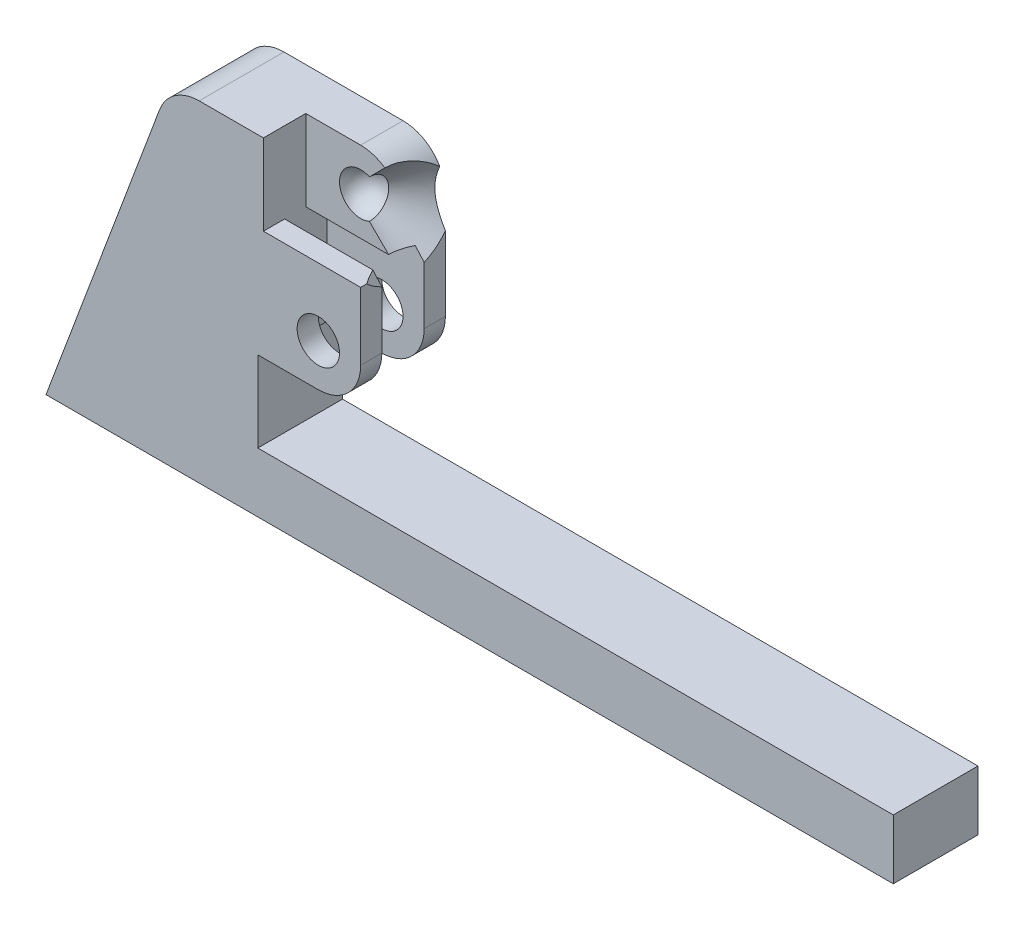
from build123d import *

# Parameters (mm, degrees)
ESQUISSE1_R             = 5
BASE_EXTRUSION_DEPTH    = 10
ESQUISSE3_W             = 32.445649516
ESQUISSE3_H             = 30.48772239
ENL_V_MAT_EXTRU_1_DEPTH = 10
ENL_V_MAT_EXTRU_2_REACH = 150.358
ESQUISSE4_W             = 27.718702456
ESQUISSE4_H             = 10


with BuildPart() as part:
    # Esquisse1 → Base-Extrusion (new, symmetric)
    with BuildSketch(Plane.XY):
        with BuildLine():
            Line((0, 35), (-28.108181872, 35))
            ThreePointArc((-28.108181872, 35), (-33.80742751, 33.216970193), (-37.474288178, 28.503719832))
            Line((-37.474288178, 28.503719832), (-64.276916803, -43.144779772))
            Line((-64.276916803, -43.144779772), (135.723083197, -43.144779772))
            Line((135.723083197, -43.144779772), (135.723083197, -29.056688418))
            Line((135.723083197, -29.056688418), (-14.276916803, -29.056688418))
            Line((-14.276916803, -29.056688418), (-14.276916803, -10))
            Line((-14.276916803, -10), (0, -10))
            ThreePointArc((0, -10), (7.071067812, -7.071067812), (10, 0))
            Line((10, 0), (10, 25))
            ThreePointArc((10, 25), (7.071067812, 32.071067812), (0, 35))
        make_face()
        with Locations(Location((0, 0, 0), (0, 0, 180))):
            Circle(ESQUISSE1_R, mode=Mode.SUBTRACT)
    extrude(amount=BASE_EXTRUSION_DEPTH, both=True)

    # Esquisse2 → Enl_vement de mati_re-R_volution1 (revolve, cut)
    with BuildSketch(Plane.XY):
        with BuildLine():
            Line((2.068297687, 29.552158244), (11.553031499, 39.051514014))
            Line((11.553031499, 39.051514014), (11.553031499, 25))
            Line((11.553031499, 25), (-5, 25))
            ThreePointArc((-5, 25), (-2.707259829, 29.203658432), (2.068297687, 29.552158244))
        make_face()
    revolve(axis=Axis((-16.032934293, 25, 0), (1, 0, 0)), mode=Mode.SUBTRACT)

    # Esquisse3 → Enl_v. mat.-Extru.1 (cut)
    with BuildSketch(Plane.XY.offset(10)):
        with Locations((3.266633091, 31.170298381)):
            Rectangle(ESQUISSE3_W, ESQUISSE3_H)
    extrude(amount=-ENL_V_MAT_EXTRU_1_DEPTH, mode=Mode.SUBTRACT)

    # Esquisse4 → Enl_v. mat.-Extru.2 (cut, up to next)
    with BuildSketch(Plane(origin=(0, 15.926437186, 0), x_dir=(-1, 0, 0), z_dir=(0, 1, 0)), mode=Mode.PRIVATE) as enl_v_mat_extru_2_sk1:
        with Locations((-0.903159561, 0)):
            Rectangle(ESQUISSE4_W, ESQUISSE4_H)
    enl_v_mat_extru_2_tool1 = extrude(enl_v_mat_extru_2_sk1.sketch, amount=-ENL_V_MAT_EXTRU_2_REACH, mode=Mode.PRIVATE) & part.part
    add(enl_v_mat_extru_2_tool1.solids().sort_by_distance((0.90316, 15.926437, 0))[0], mode=Mode.SUBTRACT)


solid = part.part
